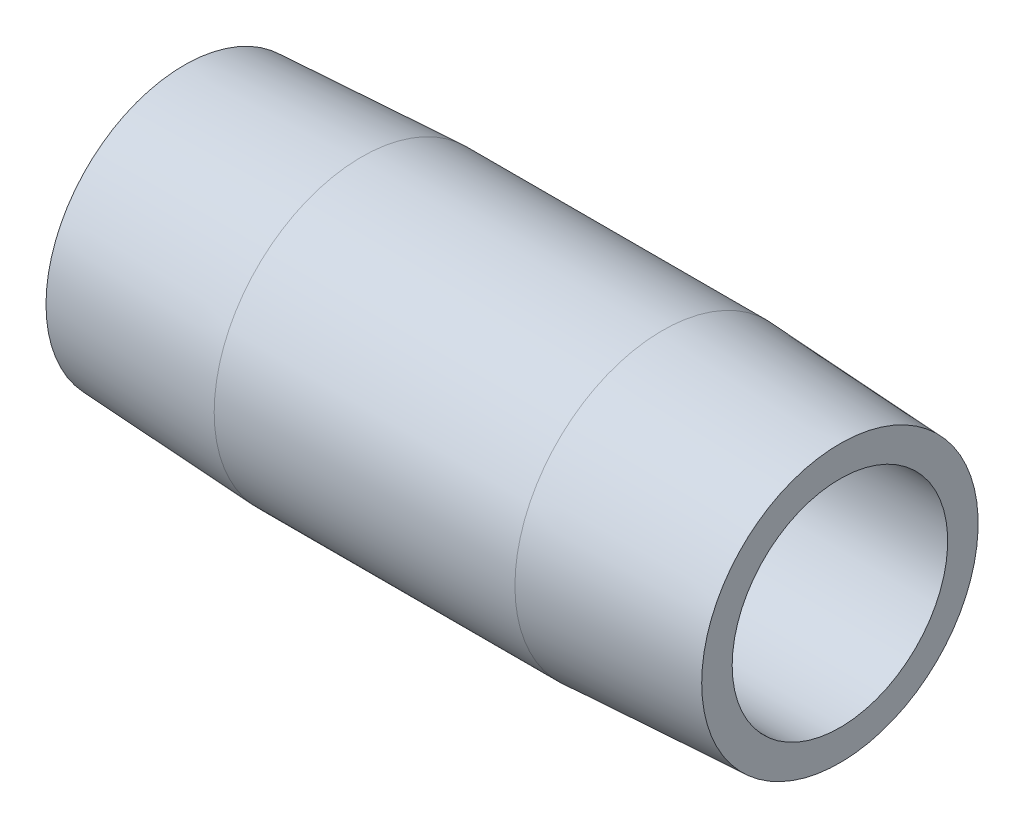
ISO-10303-21;
HEADER;
FILE_DESCRIPTION(('STEP AP214'),'2;1');
FILE_NAME('part.step','',(''),(''),'','','');
FILE_SCHEMA(('AUTOMOTIVE_DESIGN { 1 0 10303 214 1 1 1 1 }'));
ENDSEC;
DATA;
#1=APPLICATION_CONTEXT('core data for automotive mechanical design processes');
#2=APPLICATION_PROTOCOL_DEFINITION('international standard','automotive_design',2000,#1);
#3=PRODUCT_CONTEXT('',#1,'mechanical');
#4=PRODUCT('Part','Part','',(#3));
#5=PRODUCT_RELATED_PRODUCT_CATEGORY('part','',(#4));
#6=PRODUCT_DEFINITION_FORMATION('','',#4);
#7=PRODUCT_DEFINITION_CONTEXT('part definition',#1,'design');
#8=PRODUCT_DEFINITION('design','',#6,#7);
#9=PRODUCT_DEFINITION_SHAPE('','',#8);
#10=(LENGTH_UNIT() NAMED_UNIT(*) SI_UNIT(.MILLI.,.METRE.));
#11=(NAMED_UNIT(*) PLANE_ANGLE_UNIT() SI_UNIT($,.RADIAN.));
#12=(NAMED_UNIT(*) SI_UNIT($,.STERADIAN.) SOLID_ANGLE_UNIT());
#13=UNCERTAINTY_MEASURE_WITH_UNIT(LENGTH_MEASURE(1.E-05),#10,'distance_accuracy_value','');
#14=(GEOMETRIC_REPRESENTATION_CONTEXT(3) GLOBAL_UNCERTAINTY_ASSIGNED_CONTEXT((#13)) GLOBAL_UNIT_ASSIGNED_CONTEXT((#10,
#11,#12)) REPRESENTATION_CONTEXT('',''));
#15=CARTESIAN_POINT('',(0.,0.,0.));
#16=DIRECTION('',(0.,0.,1.));
#17=DIRECTION('',(1.,0.,0.));
#18=AXIS2_PLACEMENT_3D('',#15,#16,#17);
#19=CARTESIAN_POINT('',(38.1,6.2611,0.));
#20=DIRECTION('',(-1.,0.,0.));
#21=DIRECTION('',(0.,0.,1.));
#22=AXIS2_PLACEMENT_3D('',#19,#20,#21);
#23=PLANE('',#22);
#24=CARTESIAN_POINT('',(38.1,0.,0.));
#25=DIRECTION('',(-1.,0.,0.));
#26=DIRECTION('',(0.,0.,1.));
#27=AXIS2_PLACEMENT_3D('',#24,#25,#26);
#28=CIRCLE('',#27,8.03205001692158);
#29=CARTESIAN_POINT('',(38.1,0.,8.03205001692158));
#30=VERTEX_POINT('',#29);
#31=EDGE_CURVE('E10',#30,#30,#28,.T.);
#32=ORIENTED_EDGE('',*,*,#31,.F.);
#33=EDGE_LOOP('',(#32));
#34=FACE_BOUND('',#33,.T.);
#35=CARTESIAN_POINT('',(38.1,0.,0.));
#36=DIRECTION('',(-1.,0.,0.));
#37=DIRECTION('',(0.,0.,1.));
#38=AXIS2_PLACEMENT_3D('',#35,#36,#37);
#39=CIRCLE('',#38,6.2611);
#40=CARTESIAN_POINT('',(38.1,0.,6.2611));
#41=VERTEX_POINT('',#40);
#42=EDGE_CURVE('E52',#41,#41,#39,.T.);
#43=ORIENTED_EDGE('',*,*,#42,.T.);
#44=EDGE_LOOP('',(#43));
#45=FACE_BOUND('',#44,.T.);
#46=ADVANCED_FACE('F30',(#34,#45),#23,.F.);
#47=CARTESIAN_POINT('',(38.1,0.,0.));
#48=DIRECTION('',(-1.,0.,0.));
#49=DIRECTION('',(0.,0.,1.));
#50=AXIS2_PLACEMENT_3D('',#47,#48,#49);
#51=CONICAL_SURFACE('',#50,8.03205001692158,0.0523598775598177);
#52=CARTESIAN_POINT('',(27.7876,0.,0.));
#53=DIRECTION('',(-1.,0.,0.));
#54=DIRECTION('',(0.,0.,1.));
#55=AXIS2_PLACEMENT_3D('',#52,#53,#54);
#56=CIRCLE('',#55,8.57249999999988);
#57=CARTESIAN_POINT('',(27.7876,0.,8.57249999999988));
#58=VERTEX_POINT('',#57);
#59=EDGE_CURVE('E36',#58,#58,#56,.T.);
#60=ORIENTED_EDGE('',*,*,#59,.F.);
#61=EDGE_LOOP('',(#60));
#62=FACE_BOUND('',#61,.T.);
#63=ORIENTED_EDGE('',*,*,#31,.T.);
#64=EDGE_LOOP('',(#63));
#65=FACE_BOUND('',#64,.T.);
#66=ADVANCED_FACE('F77',(#62,#65),#51,.T.);
#67=CARTESIAN_POINT('',(0.,0.,0.));
#68=DIRECTION('',(-1.,0.,0.));
#69=DIRECTION('',(0.,0.,1.));
#70=AXIS2_PLACEMENT_3D('',#67,#68,#69);
#71=CYLINDRICAL_SURFACE('',#70,8.57249999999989);
#72=CARTESIAN_POINT('',(10.3124,0.,0.));
#73=DIRECTION('',(-1.,0.,0.));
#74=DIRECTION('',(0.,0.,1.));
#75=AXIS2_PLACEMENT_3D('',#72,#73,#74);
#76=CIRCLE('',#75,8.57249999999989);
#77=CARTESIAN_POINT('',(10.3124,0.,8.57249999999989));
#78=VERTEX_POINT('',#77);
#79=EDGE_CURVE('E40',#78,#78,#76,.T.);
#80=ORIENTED_EDGE('',*,*,#79,.F.);
#81=EDGE_LOOP('',(#80));
#82=FACE_BOUND('',#81,.T.);
#83=ORIENTED_EDGE('',*,*,#59,.T.);
#84=EDGE_LOOP('',(#83));
#85=FACE_BOUND('',#84,.T.);
#86=ADVANCED_FACE('F72',(#82,#85),#71,.T.);
#87=CARTESIAN_POINT('',(10.3124,0.,0.));
#88=DIRECTION('',(1.,0.,0.));
#89=DIRECTION('',(0.,0.,-1.));
#90=AXIS2_PLACEMENT_3D('',#87,#88,#89);
#91=CONICAL_SURFACE('',#90,8.57249999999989,0.0523598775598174);
#92=CARTESIAN_POINT('',(0.,0.,0.));
#93=DIRECTION('',(-1.,0.,0.));
#94=DIRECTION('',(0.,0.,1.));
#95=AXIS2_PLACEMENT_3D('',#92,#93,#94);
#96=CIRCLE('',#95,8.03205001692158);
#97=CARTESIAN_POINT('',(0.,0.,8.03205001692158));
#98=VERTEX_POINT('',#97);
#99=EDGE_CURVE('E44',#98,#98,#96,.T.);
#100=ORIENTED_EDGE('',*,*,#99,.F.);
#101=EDGE_LOOP('',(#100));
#102=FACE_BOUND('',#101,.T.);
#103=ORIENTED_EDGE('',*,*,#79,.T.);
#104=EDGE_LOOP('',(#103));
#105=FACE_BOUND('',#104,.T.);
#106=ADVANCED_FACE('F66',(#102,#105),#91,.T.);
#107=CARTESIAN_POINT('',(0.,6.26110000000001,0.));
#108=DIRECTION('',(1.,0.,0.));
#109=DIRECTION('',(0.,0.,-1.));
#110=AXIS2_PLACEMENT_3D('',#107,#108,#109);
#111=PLANE('',#110);
#112=CARTESIAN_POINT('',(0.,0.,0.));
#113=DIRECTION('',(-1.,0.,0.));
#114=DIRECTION('',(0.,0.,1.));
#115=AXIS2_PLACEMENT_3D('',#112,#113,#114);
#116=CIRCLE('',#115,6.26110000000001);
#117=CARTESIAN_POINT('',(0.,0.,6.26110000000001));
#118=VERTEX_POINT('',#117);
#119=EDGE_CURVE('E49',#118,#118,#116,.T.);
#120=ORIENTED_EDGE('',*,*,#119,.F.);
#121=EDGE_LOOP('',(#120));
#122=FACE_BOUND('',#121,.T.);
#123=ORIENTED_EDGE('',*,*,#99,.T.);
#124=EDGE_LOOP('',(#123));
#125=FACE_BOUND('',#124,.T.);
#126=ADVANCED_FACE('F60',(#122,#125),#111,.F.);
#127=CARTESIAN_POINT('',(0.,0.,0.));
#128=DIRECTION('',(-1.,0.,0.));
#129=DIRECTION('',(0.,0.,1.));
#130=AXIS2_PLACEMENT_3D('',#127,#128,#129);
#131=CYLINDRICAL_SURFACE('',#130,6.26110000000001);
#132=ORIENTED_EDGE('',*,*,#42,.F.);
#133=EDGE_LOOP('',(#132));
#134=FACE_BOUND('',#133,.T.);
#135=ORIENTED_EDGE('',*,*,#119,.T.);
#136=EDGE_LOOP('',(#135));
#137=FACE_BOUND('',#136,.T.);
#138=ADVANCED_FACE('F57',(#134,#137),#131,.F.);
#139=CLOSED_SHELL('',(#46,#66,#86,#106,#126,#138));
#140=MANIFOLD_SOLID_BREP('B2',#139);
#141=ADVANCED_BREP_SHAPE_REPRESENTATION('',(#18,#140),#14);
#142=SHAPE_DEFINITION_REPRESENTATION(#9,#141);
ENDSEC;
END-ISO-10303-21;
